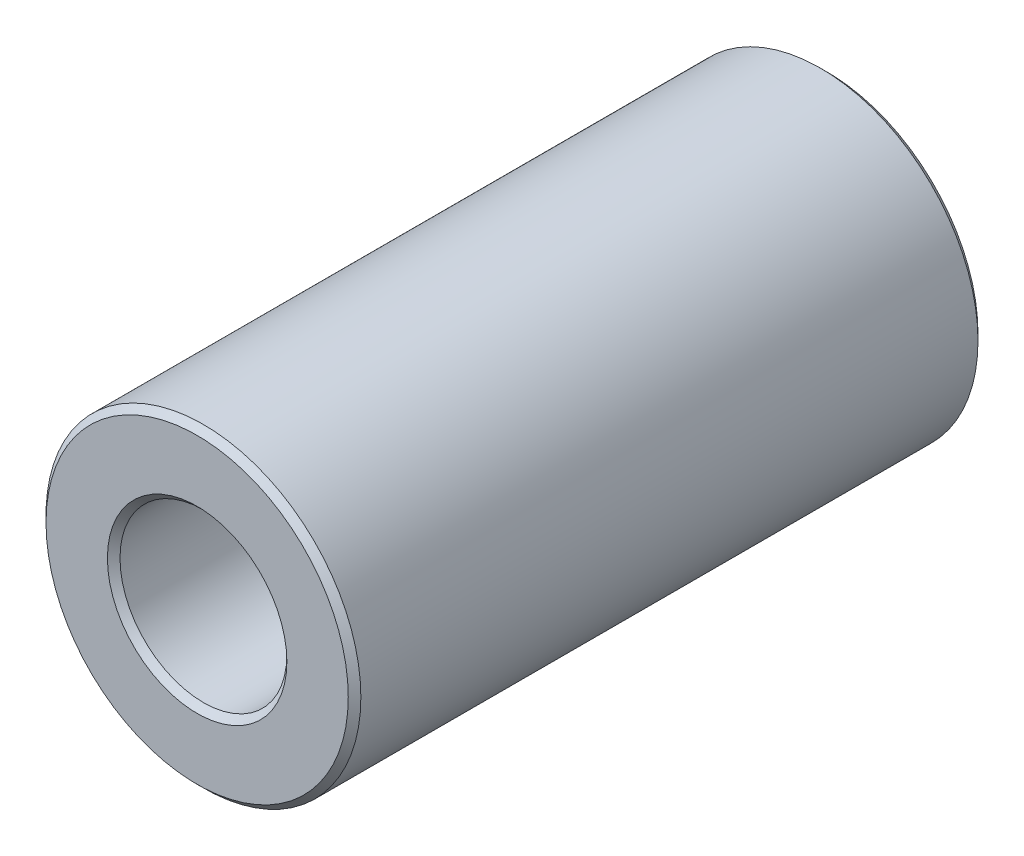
from build123d import *

# Parameters (mm, degrees)
SKETCH1_R           = 5
SKETCH1_R_2         = 2.65
BOSS_EXTRUDE2_DEPTH = 10
CHAMFER3_SIZE       = 0.2


with BuildPart() as part:
    # Sketch1 → Boss-Extrude2 (new, symmetric)
    with BuildSketch(Plane.XY):
        Circle(SKETCH1_R)
        Circle(SKETCH1_R_2, mode=Mode.SUBTRACT)
    extrude(amount=BOSS_EXTRUDE2_DEPTH, both=True)

    # Chamfer3
    chamfer3_edges = [part.edges().sort_by_distance(p)[0] for p in [
        (-5, 0, -10),
        (-5, 0, 10),
        (-2.65, 0, -10),
        (-2.65, 0, 10),
    ]]
    chamfer(chamfer3_edges, length=CHAMFER3_SIZE)


solid = part.part
